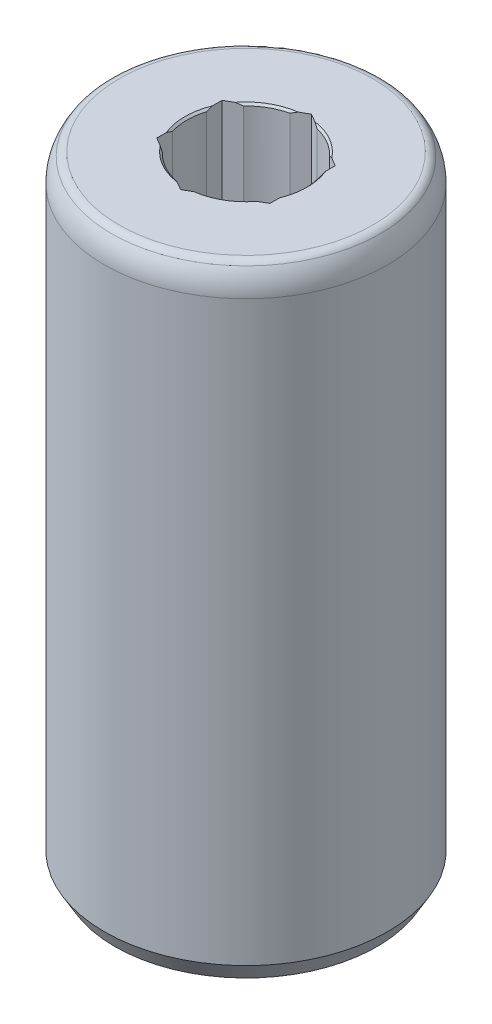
from build123d import *

# Parameters (mm, degrees)
F_1_4_20_TAPPED_HOLE1_D      = 5.1054
F_1_4_20_TAPPED_HOLE1_DEPTH  = 12.192
F_1_4_20_TAPPED_HOLE1_TIP    = 1.533816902
G_0_261_DIAMETER_HOLE1_D     = 6.6294
G_0_261_DIAMETER_HOLE1_DEPTH = 6.35
G_0_261_DIAMETER_HOLE1_TIP   = 1.991672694
CUT_EXTRUDE1_DEPTH           = 5.588


with BuildPart() as part:
    # Sketch1 → Revolve1 (revolve)
    with BuildSketch(Plane.XY, mode=Mode.PRIVATE) as revolve1_sk:
        with BuildLine():
            Line((0, -19.05), (7.350912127, -19.05))
            Line((7.350912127, -19.05), (7.9375, -18.034))
            Line((7.9375, -18.034), (7.9375, 14.351))
            ThreePointArc((7.9375, 14.351), (7.832595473, 15.035557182), (7.52751003, 15.657285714))
            ThreePointArc((7.52751003, 15.657285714), (7.345777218, 15.817293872), (7.110618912, 15.875))
            Line((7.110618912, 15.875), (0, 15.875))
            Line((0, 15.875), (0, -19.05))
        make_face()
    revolve(revolve1_sk.sketch.rotate(Axis((0, -19.05, 0), (0, 1, 0)), 90), axis=Axis((0, -19.05, 0), (0, 1, 0)))

    # 1_4-20 Tapped Hole1
    with Locations(Plane(origin=(0, -19.05, 0), x_dir=(-1, 0, 0), z_dir=(0, -1, 0))):
        with Locations((0, 0)):
            Hole(F_1_4_20_TAPPED_HOLE1_D / 2, depth=F_1_4_20_TAPPED_HOLE1_DEPTH)
            with Locations((0, 0, -(F_1_4_20_TAPPED_HOLE1_DEPTH + F_1_4_20_TAPPED_HOLE1_TIP / 2))):  # 118° drill point
                Cone(0, F_1_4_20_TAPPED_HOLE1_D / 2, F_1_4_20_TAPPED_HOLE1_TIP, mode=Mode.SUBTRACT)

    # G _0.261_ Diameter Hole1
    with Locations(Plane(origin=(0, 15.875, 0), x_dir=(1, 0, 0), z_dir=(0, 1, 0))):
        with Locations((0, 0)):
            Hole(G_0_261_DIAMETER_HOLE1_D / 2, depth=G_0_261_DIAMETER_HOLE1_DEPTH)
            with Locations((0, 0, -(G_0_261_DIAMETER_HOLE1_DEPTH + G_0_261_DIAMETER_HOLE1_TIP / 2))):  # 118° drill point
                Cone(0, G_0_261_DIAMETER_HOLE1_D / 2, G_0_261_DIAMETER_HOLE1_TIP, mode=Mode.SUBTRACT)

    # Sketch6 → Cut-Extrude1 (cut)
    with BuildSketch(Plane(origin=(0, 15.875, 0), x_dir=(1, 0, 0), z_dir=(0, 1, 0))):
        Polygon((0, 3.666174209), (-3.175, 1.833087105), (-3.175, -1.833087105), (0, -3.666174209), (3.175, -1.833087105), (3.175, 1.833087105), align=None)
    extrude(amount=-CUT_EXTRUDE1_DEPTH, mode=Mode.SUBTRACT)

    # Sketch7 → Cut-Revolve3 (revolve, cut)
    with BuildSketch(Plane.XY, mode=Mode.PRIVATE) as cut_revolve3_sk:
        Polygon((3.429, 15.875), (3.175, 15.621), (3.175, 15.875), align=None)
    revolve(cut_revolve3_sk.sketch.rotate(Axis((0, 7.533327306, 0), (0, 1, 0)), 90), axis=Axis((0, 7.533327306, 0), (0, 1, 0)), mode=Mode.SUBTRACT)


solid = part.part
